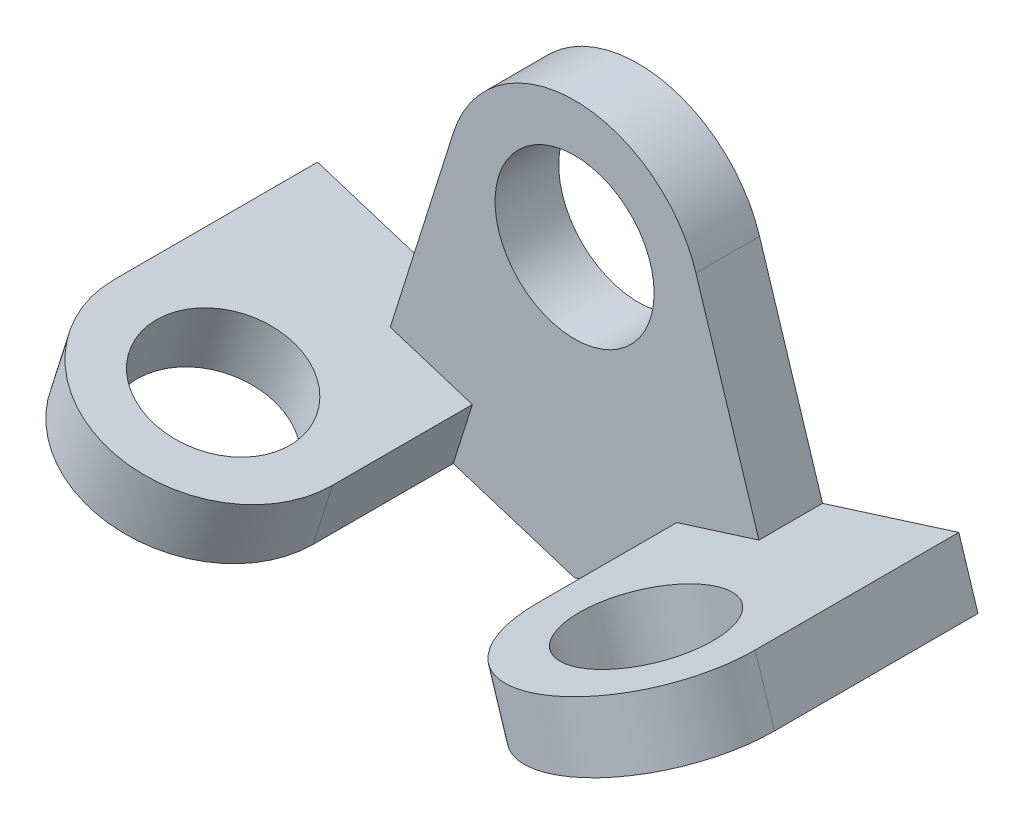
ISO-10303-21;
HEADER;
FILE_DESCRIPTION(('STEP AP214'),'2;1');
FILE_NAME('part.step','',(''),(''),'','','');
FILE_SCHEMA(('AUTOMOTIVE_DESIGN { 1 0 10303 214 1 1 1 1 }'));
ENDSEC;
DATA;
#1=APPLICATION_CONTEXT('core data for automotive mechanical design processes');
#2=APPLICATION_PROTOCOL_DEFINITION('international standard','automotive_design',2000,#1);
#3=PRODUCT_CONTEXT('',#1,'mechanical');
#4=PRODUCT('Part','Part','',(#3));
#5=PRODUCT_RELATED_PRODUCT_CATEGORY('part','',(#4));
#6=PRODUCT_DEFINITION_FORMATION('','',#4);
#7=PRODUCT_DEFINITION_CONTEXT('part definition',#1,'design');
#8=PRODUCT_DEFINITION('design','',#6,#7);
#9=PRODUCT_DEFINITION_SHAPE('','',#8);
#10=(LENGTH_UNIT() NAMED_UNIT(*) SI_UNIT(.MILLI.,.METRE.));
#11=(NAMED_UNIT(*) PLANE_ANGLE_UNIT() SI_UNIT($,.RADIAN.));
#12=(NAMED_UNIT(*) SI_UNIT($,.STERADIAN.) SOLID_ANGLE_UNIT());
#13=UNCERTAINTY_MEASURE_WITH_UNIT(LENGTH_MEASURE(1.E-05),#10,'distance_accuracy_value','');
#14=(GEOMETRIC_REPRESENTATION_CONTEXT(3) GLOBAL_UNCERTAINTY_ASSIGNED_CONTEXT((#13)) GLOBAL_UNIT_ASSIGNED_CONTEXT((#10,
#11,#12)) REPRESENTATION_CONTEXT('',''));
#15=CARTESIAN_POINT('',(0.,0.,0.));
#16=DIRECTION('',(0.,0.,1.));
#17=DIRECTION('',(1.,0.,0.));
#18=AXIS2_PLACEMENT_3D('',#15,#16,#17);
#19=CARTESIAN_POINT('',(0.,45.,10.));
#20=DIRECTION('',(0.,0.,-1.));
#21=DIRECTION('',(-1.,0.,0.));
#22=AXIS2_PLACEMENT_3D('',#19,#20,#21);
#23=PLANE('',#22);
#24=DIRECTION('',(0.953716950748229,-0.300705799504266,0.));
#25=VECTOR('',#24,1.);
#26=CARTESIAN_POINT('',(-9.8984118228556,13.6062485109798,10.));
#27=LINE('',#26,#25);
#28=CARTESIAN_POINT('',(-28.9727508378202,19.6203645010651,10.));
#29=VERTEX_POINT('',#28);
#30=CARTESIAN_POINT('',(-16.0672810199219,15.5512854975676,10.));
#31=VERTEX_POINT('',#30);
#32=EDGE_CURVE('E61',#29,#31,#27,.T.);
#33=ORIENTED_EDGE('',*,*,#32,.T.);
#34=DIRECTION('',(-0.300705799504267,-0.953716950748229,0.));
#35=VECTOR('',#34,1.);
#36=CARTESIAN_POINT('',(-6.1688691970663,46.9450369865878,10.));
#37=LINE('',#36,#35);
#38=CARTESIAN_POINT('',(-19.0743390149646,6.01411599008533,10.));
#39=VERTEX_POINT('',#38);
#40=EDGE_CURVE('E226',#31,#39,#37,.T.);
#41=ORIENTED_EDGE('',*,*,#40,.T.);
#42=DIRECTION('',(0.953716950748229,-0.300705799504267,0.));
#43=VECTOR('',#42,1.);
#44=CARTESIAN_POINT('',(0.,0.,10.));
#45=LINE('',#44,#43);
#46=CARTESIAN_POINT('',(0.,0.,10.));
#47=VERTEX_POINT('',#46);
#48=EDGE_CURVE('E160',#39,#47,#45,.T.);
#49=ORIENTED_EDGE('',*,*,#48,.T.);
#50=DIRECTION('',(0.953716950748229,0.300705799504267,0.));
#51=VECTOR('',#50,1.);
#52=CARTESIAN_POINT('',(0.,0.,10.));
#53=LINE('',#52,#51);
#54=CARTESIAN_POINT('',(19.0743390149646,6.01411599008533,10.));
#55=VERTEX_POINT('',#54);
#56=EDGE_CURVE('E250',#47,#55,#53,.T.);
#57=ORIENTED_EDGE('',*,*,#56,.T.);
#58=DIRECTION('',(-0.300705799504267,0.953716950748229,0.));
#59=VECTOR('',#58,1.);
#60=CARTESIAN_POINT('',(6.16886919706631,46.9450369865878,10.));
#61=LINE('',#60,#59);
#62=CARTESIAN_POINT('',(16.0672810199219,15.5512854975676,10.));
#63=VERTEX_POINT('',#62);
#64=EDGE_CURVE('E68',#55,#63,#61,.T.);
#65=ORIENTED_EDGE('',*,*,#64,.T.);
#66=DIRECTION('',(0.953716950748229,0.300705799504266,0.));
#67=VECTOR('',#66,1.);
#68=CARTESIAN_POINT('',(9.8984118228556,13.6062485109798,10.));
#69=LINE('',#68,#67);
#70=CARTESIAN_POINT('',(28.9727508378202,19.6203645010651,10.));
#71=VERTEX_POINT('',#70);
#72=EDGE_CURVE('E163',#63,#71,#69,.T.);
#73=ORIENTED_EDGE('',*,*,#72,.T.);
#74=DIRECTION('',(-0.300705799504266,0.953716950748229,0.));
#75=VECTOR('',#74,1.);
#76=CARTESIAN_POINT('',(31.9798088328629,10.0831949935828,10.));
#77=LINE('',#76,#75);
#78=CARTESIAN_POINT('',(19.0743390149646,51.0141159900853,10.));
#79=VERTEX_POINT('',#78);
#80=EDGE_CURVE('E253',#71,#79,#77,.T.);
#81=ORIENTED_EDGE('',*,*,#80,.T.);
#82=CARTESIAN_POINT('',(0.,45.,10.));
#83=DIRECTION('',(0.,0.,1.));
#84=DIRECTION('',(-1.,0.,0.));
#85=AXIS2_PLACEMENT_3D('',#82,#83,#84);
#86=CIRCLE('',#85,20.);
#87=CARTESIAN_POINT('',(-19.0743390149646,51.0141159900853,10.));
#88=VERTEX_POINT('',#87);
#89=EDGE_CURVE('E240',#79,#88,#86,.T.);
#90=ORIENTED_EDGE('',*,*,#89,.T.);
#91=DIRECTION('',(-0.300705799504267,-0.953716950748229,0.));
#92=VECTOR('',#91,1.);
#93=CARTESIAN_POINT('',(-31.9798088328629,10.0831949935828,10.));
#94=LINE('',#93,#92);
#95=EDGE_CURVE('E244',#88,#29,#94,.T.);
#96=ORIENTED_EDGE('',*,*,#95,.T.);
#97=EDGE_LOOP('',(#33,#41,#49,#57,#65,#73,#81,#90,#96));
#98=FACE_BOUND('',#97,.T.);
#99=CARTESIAN_POINT('',(0.,45.,10.));
#100=DIRECTION('',(0.,0.,1.));
#101=DIRECTION('',(1.,0.,0.));
#102=AXIS2_PLACEMENT_3D('',#99,#100,#101);
#103=CIRCLE('',#102,12.5);
#104=CARTESIAN_POINT('',(12.5,45.,10.));
#105=VERTEX_POINT('',#104);
#106=EDGE_CURVE('E232',#105,#105,#103,.T.);
#107=ORIENTED_EDGE('',*,*,#106,.F.);
#108=EDGE_LOOP('',(#107));
#109=FACE_BOUND('',#108,.T.);
#110=ADVANCED_FACE('F45',(#98,#109),#23,.F.);
#111=CARTESIAN_POINT('',(0.,45.,0.));
#112=DIRECTION('',(0.,0.,-1.));
#113=DIRECTION('',(-1.,0.,0.));
#114=AXIS2_PLACEMENT_3D('',#111,#112,#113);
#115=PLANE('',#114);
#116=DIRECTION('',(0.953716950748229,0.300705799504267,0.));
#117=VECTOR('',#116,1.);
#118=CARTESIAN_POINT('',(0.,0.,0.));
#119=LINE('',#118,#117);
#120=CARTESIAN_POINT('',(0.,0.,0.));
#121=VERTEX_POINT('',#120);
#122=CARTESIAN_POINT('',(53.4081492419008,16.8395247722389,0.));
#123=VERTEX_POINT('',#122);
#124=EDGE_CURVE('E266',#121,#123,#119,.T.);
#125=ORIENTED_EDGE('',*,*,#124,.F.);
#126=DIRECTION('',(0.953716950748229,-0.300705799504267,0.));
#127=VECTOR('',#126,1.);
#128=CARTESIAN_POINT('',(0.,0.,0.));
#129=LINE('',#128,#127);
#130=CARTESIAN_POINT('',(-53.4081492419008,16.8395247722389,0.));
#131=VERTEX_POINT('',#130);
#132=EDGE_CURVE('E263',#131,#121,#129,.T.);
#133=ORIENTED_EDGE('',*,*,#132,.F.);
#134=DIRECTION('',(0.300705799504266,0.953716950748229,0.));
#135=VECTOR('',#134,1.);
#136=CARTESIAN_POINT('',(-50.4010912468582,26.3766942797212,0.));
#137=LINE('',#136,#135);
#138=CARTESIAN_POINT('',(-50.4010912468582,26.3766942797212,0.));
#139=VERTEX_POINT('',#138);
#140=EDGE_CURVE('E179',#131,#139,#137,.T.);
#141=ORIENTED_EDGE('',*,*,#140,.T.);
#142=DIRECTION('',(0.953716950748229,-0.300705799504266,0.));
#143=VECTOR('',#142,1.);
#144=CARTESIAN_POINT('',(-16.0672810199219,15.5512854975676,0.));
#145=LINE('',#144,#143);
#146=CARTESIAN_POINT('',(-28.9727508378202,19.6203645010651,0.));
#147=VERTEX_POINT('',#146);
#148=EDGE_CURVE('E175',#139,#147,#145,.T.);
#149=ORIENTED_EDGE('',*,*,#148,.T.);
#150=DIRECTION('',(-0.300705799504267,-0.953716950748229,0.));
#151=VECTOR('',#150,1.);
#152=CARTESIAN_POINT('',(-31.9798088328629,10.0831949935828,0.));
#153=LINE('',#152,#151);
#154=CARTESIAN_POINT('',(-19.0743390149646,51.0141159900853,0.));
#155=VERTEX_POINT('',#154);
#156=EDGE_CURVE('E260',#155,#147,#153,.T.);
#157=ORIENTED_EDGE('',*,*,#156,.F.);
#158=CARTESIAN_POINT('',(0.,45.,0.));
#159=DIRECTION('',(0.,0.,1.));
#160=DIRECTION('',(-1.,0.,0.));
#161=AXIS2_PLACEMENT_3D('',#158,#159,#160);
#162=CIRCLE('',#161,20.);
#163=CARTESIAN_POINT('',(19.0743390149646,51.0141159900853,0.));
#164=VERTEX_POINT('',#163);
#165=EDGE_CURVE('E236',#164,#155,#162,.T.);
#166=ORIENTED_EDGE('',*,*,#165,.F.);
#167=DIRECTION('',(-0.300705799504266,0.953716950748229,0.));
#168=VECTOR('',#167,1.);
#169=CARTESIAN_POINT('',(31.9798088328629,10.0831949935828,0.));
#170=LINE('',#169,#168);
#171=CARTESIAN_POINT('',(28.9727508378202,19.6203645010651,0.));
#172=VERTEX_POINT('',#171);
#173=EDGE_CURVE('E245',#172,#164,#170,.T.);
#174=ORIENTED_EDGE('',*,*,#173,.F.);
#175=DIRECTION('',(0.953716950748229,0.300705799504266,0.));
#176=VECTOR('',#175,1.);
#177=CARTESIAN_POINT('',(16.0672810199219,15.5512854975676,0.));
#178=LINE('',#177,#176);
#179=CARTESIAN_POINT('',(50.4010912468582,26.3766942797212,0.));
#180=VERTEX_POINT('',#179);
#181=EDGE_CURVE('E183',#172,#180,#178,.T.);
#182=ORIENTED_EDGE('',*,*,#181,.T.);
#183=DIRECTION('',(0.300705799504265,-0.953716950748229,0.));
#184=VECTOR('',#183,1.);
#185=CARTESIAN_POINT('',(50.4010912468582,26.3766942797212,0.));
#186=LINE('',#185,#184);
#187=EDGE_CURVE('E209',#180,#123,#186,.T.);
#188=ORIENTED_EDGE('',*,*,#187,.T.);
#189=EDGE_LOOP('',(#125,#133,#141,#149,#157,#166,#174,#182,#188));
#190=FACE_BOUND('',#189,.T.);
#191=CARTESIAN_POINT('',(0.,45.,0.));
#192=DIRECTION('',(0.,0.,1.));
#193=DIRECTION('',(1.,0.,0.));
#194=AXIS2_PLACEMENT_3D('',#191,#192,#193);
#195=CIRCLE('',#194,12.5);
#196=CARTESIAN_POINT('',(12.5,45.,0.));
#197=VERTEX_POINT('',#196);
#198=EDGE_CURVE('E231',#197,#197,#195,.T.);
#199=ORIENTED_EDGE('',*,*,#198,.T.);
#200=EDGE_LOOP('',(#199));
#201=FACE_BOUND('',#200,.T.);
#202=ADVANCED_FACE('F295',(#190,#201),#115,.T.);
#203=CARTESIAN_POINT('',(0.,45.,10.));
#204=DIRECTION('',(0.,0.,-1.));
#205=DIRECTION('',(-1.,0.,0.));
#206=AXIS2_PLACEMENT_3D('',#203,#204,#205);
#207=CYLINDRICAL_SURFACE('',#206,20.);
#208=ORIENTED_EDGE('',*,*,#165,.T.);
#209=DIRECTION('',(0.,0.,-1.));
#210=VECTOR('',#209,1.);
#211=CARTESIAN_POINT('',(-19.0743390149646,51.0141159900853,10.));
#212=LINE('',#211,#210);
#213=EDGE_CURVE('E278',#88,#155,#212,.T.);
#214=ORIENTED_EDGE('',*,*,#213,.F.);
#215=ORIENTED_EDGE('',*,*,#89,.F.);
#216=DIRECTION('',(0.,0.,-1.));
#217=VECTOR('',#216,1.);
#218=CARTESIAN_POINT('',(19.0743390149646,51.0141159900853,10.));
#219=LINE('',#218,#217);
#220=EDGE_CURVE('E256',#79,#164,#219,.T.);
#221=ORIENTED_EDGE('',*,*,#220,.T.);
#222=EDGE_LOOP('',(#208,#214,#215,#221));
#223=FACE_BOUND('',#222,.T.);
#224=ADVANCED_FACE('F47',(#223),#207,.T.);
#225=CARTESIAN_POINT('',(-31.9798088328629,10.0831949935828,10.));
#226=DIRECTION('',(0.953716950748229,-0.300705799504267,0.));
#227=DIRECTION('',(0.300705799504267,0.953716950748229,0.));
#228=AXIS2_PLACEMENT_3D('',#225,#226,#227);
#229=PLANE('',#228);
#230=ORIENTED_EDGE('',*,*,#156,.T.);
#231=DIRECTION('',(0.,0.,1.));
#232=VECTOR('',#231,1.);
#233=CARTESIAN_POINT('',(-28.9727508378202,19.6203645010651,10.));
#234=LINE('',#233,#232);
#235=EDGE_CURVE('E11',#147,#29,#234,.T.);
#236=ORIENTED_EDGE('',*,*,#235,.T.);
#237=ORIENTED_EDGE('',*,*,#95,.F.);
#238=ORIENTED_EDGE('',*,*,#213,.T.);
#239=EDGE_LOOP('',(#230,#236,#237,#238));
#240=FACE_BOUND('',#239,.T.);
#241=ADVANCED_FACE('F377',(#240),#229,.F.);
#242=CARTESIAN_POINT('',(0.,0.,10.));
#243=DIRECTION('',(0.300705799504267,0.953716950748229,0.));
#244=DIRECTION('',(-0.953716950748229,0.300705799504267,0.));
#245=AXIS2_PLACEMENT_3D('',#242,#243,#244);
#246=PLANE('',#245);
#247=CARTESIAN_POINT('',(-36.2412441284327,11.4268203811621,32.));
#248=DIRECTION('',(0.300705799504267,0.953716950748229,0.));
#249=DIRECTION('',(-0.953716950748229,0.300705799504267,0.));
#250=AXIS2_PLACEMENT_3D('',#247,#248,#249);
#251=CIRCLE('',#250,11.);
#252=CARTESIAN_POINT('',(-46.7321305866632,14.7345841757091,32.));
#253=VERTEX_POINT('',#252);
#254=EDGE_CURVE('E327',#253,#253,#251,.T.);
#255=ORIENTED_EDGE('',*,*,#254,.T.);
#256=EDGE_LOOP('',(#255));
#257=FACE_BOUND('',#256,.T.);
#258=ORIENTED_EDGE('',*,*,#48,.F.);
#259=DIRECTION('',(0.,0.,-1.));
#260=VECTOR('',#259,1.);
#261=CARTESIAN_POINT('',(-19.0743390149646,6.01411599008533,32.));
#262=LINE('',#261,#260);
#263=CARTESIAN_POINT('',(-19.0743390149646,6.01411599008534,32.));
#264=VERTEX_POINT('',#263);
#265=EDGE_CURVE('E157',#264,#39,#262,.T.);
#266=ORIENTED_EDGE('',*,*,#265,.F.);
#267=CARTESIAN_POINT('',(-36.2412441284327,11.4268203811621,32.));
#268=DIRECTION('',(0.300705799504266,0.953716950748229,0.));
#269=DIRECTION('',(0.953716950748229,-0.300705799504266,0.));
#270=AXIS2_PLACEMENT_3D('',#267,#268,#269);
#271=CIRCLE('',#270,18.);
#272=CARTESIAN_POINT('',(-53.4081492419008,16.8395247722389,32.));
#273=VERTEX_POINT('',#272);
#274=EDGE_CURVE('E140',#273,#264,#271,.T.);
#275=ORIENTED_EDGE('',*,*,#274,.F.);
#276=DIRECTION('',(0.,0.,-1.));
#277=VECTOR('',#276,1.);
#278=CARTESIAN_POINT('',(-53.4081492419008,16.8395247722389,32.));
#279=LINE('',#278,#277);
#280=EDGE_CURVE('E169',#273,#131,#279,.T.);
#281=ORIENTED_EDGE('',*,*,#280,.T.);
#282=ORIENTED_EDGE('',*,*,#132,.T.);
#283=DIRECTION('',(0.,0.,-1.));
#284=VECTOR('',#283,1.);
#285=CARTESIAN_POINT('',(0.,0.,10.));
#286=LINE('',#285,#284);
#287=EDGE_CURVE('E274',#47,#121,#286,.T.);
#288=ORIENTED_EDGE('',*,*,#287,.F.);
#289=EDGE_LOOP('',(#258,#266,#275,#281,#282,#288));
#290=FACE_BOUND('',#289,.T.);
#291=ADVANCED_FACE('F158',(#257,#290),#246,.F.);
#292=CARTESIAN_POINT('',(0.,0.,10.));
#293=DIRECTION('',(-0.300705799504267,0.953716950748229,0.));
#294=DIRECTION('',(-0.953716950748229,-0.300705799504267,0.));
#295=AXIS2_PLACEMENT_3D('',#292,#293,#294);
#296=PLANE('',#295);
#297=CARTESIAN_POINT('',(36.2412441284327,11.4268203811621,32.));
#298=DIRECTION('',(-0.300705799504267,0.953716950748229,0.));
#299=DIRECTION('',(-0.953716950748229,-0.300705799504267,0.));
#300=AXIS2_PLACEMENT_3D('',#297,#298,#299);
#301=CIRCLE('',#300,11.);
#302=CARTESIAN_POINT('',(25.7503576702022,8.1190565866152,32.));
#303=VERTEX_POINT('',#302);
#304=EDGE_CURVE('E318',#303,#303,#301,.T.);
#305=ORIENTED_EDGE('',*,*,#304,.T.);
#306=EDGE_LOOP('',(#305));
#307=FACE_BOUND('',#306,.T.);
#308=DIRECTION('',(0.,0.,-1.));
#309=VECTOR('',#308,1.);
#310=CARTESIAN_POINT('',(19.0743390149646,6.01411599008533,32.));
#311=LINE('',#310,#309);
#312=CARTESIAN_POINT('',(19.0743390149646,6.01411599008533,32.));
#313=VERTEX_POINT('',#312);
#314=EDGE_CURVE('E191',#313,#55,#311,.T.);
#315=ORIENTED_EDGE('',*,*,#314,.T.);
#316=ORIENTED_EDGE('',*,*,#56,.F.);
#317=ORIENTED_EDGE('',*,*,#287,.T.);
#318=ORIENTED_EDGE('',*,*,#124,.T.);
#319=DIRECTION('',(0.,0.,-1.));
#320=VECTOR('',#319,1.);
#321=CARTESIAN_POINT('',(53.4081492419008,16.8395247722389,32.));
#322=LINE('',#321,#320);
#323=CARTESIAN_POINT('',(53.4081492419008,16.8395247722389,32.));
#324=VERTEX_POINT('',#323);
#325=EDGE_CURVE('E204',#324,#123,#322,.T.);
#326=ORIENTED_EDGE('',*,*,#325,.F.);
#327=CARTESIAN_POINT('',(36.2412441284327,11.4268203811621,32.));
#328=DIRECTION('',(-0.300705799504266,0.953716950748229,0.));
#329=DIRECTION('',(-0.953716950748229,-0.300705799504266,0.));
#330=AXIS2_PLACEMENT_3D('',#327,#328,#329);
#331=CIRCLE('',#330,18.);
#332=EDGE_CURVE('E208',#313,#324,#331,.T.);
#333=ORIENTED_EDGE('',*,*,#332,.F.);
#334=EDGE_LOOP('',(#315,#316,#317,#318,#326,#333));
#335=FACE_BOUND('',#334,.T.);
#336=ADVANCED_FACE('F313',(#307,#335),#296,.F.);
#337=CARTESIAN_POINT('',(31.9798088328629,10.0831949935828,10.));
#338=DIRECTION('',(-0.953716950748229,-0.300705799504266,0.));
#339=DIRECTION('',(0.300705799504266,-0.953716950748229,0.));
#340=AXIS2_PLACEMENT_3D('',#337,#338,#339);
#341=PLANE('',#340);
#342=ORIENTED_EDGE('',*,*,#80,.F.);
#343=DIRECTION('',(0.,0.,-1.));
#344=VECTOR('',#343,1.);
#345=CARTESIAN_POINT('',(28.9727508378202,19.6203645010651,10.));
#346=LINE('',#345,#344);
#347=EDGE_CURVE('E54',#71,#172,#346,.T.);
#348=ORIENTED_EDGE('',*,*,#347,.T.);
#349=ORIENTED_EDGE('',*,*,#173,.T.);
#350=ORIENTED_EDGE('',*,*,#220,.F.);
#351=EDGE_LOOP('',(#342,#348,#349,#350));
#352=FACE_BOUND('',#351,.T.);
#353=ADVANCED_FACE('F287',(#352),#341,.F.);
#354=CARTESIAN_POINT('',(0.,45.,10.));
#355=DIRECTION('',(0.,0.,-1.));
#356=DIRECTION('',(-1.,0.,0.));
#357=AXIS2_PLACEMENT_3D('',#354,#355,#356);
#358=CYLINDRICAL_SURFACE('',#357,12.5);
#359=ORIENTED_EDGE('',*,*,#106,.T.);
#360=EDGE_LOOP('',(#359));
#361=FACE_BOUND('',#360,.T.);
#362=ORIENTED_EDGE('',*,*,#198,.F.);
#363=EDGE_LOOP('',(#362));
#364=FACE_BOUND('',#363,.T.);
#365=ADVANCED_FACE('F369',(#361,#364),#358,.F.);
#366=CARTESIAN_POINT('',(19.0743390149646,6.01411599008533,32.));
#367=DIRECTION('',(-0.953716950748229,-0.300705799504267,0.));
#368=DIRECTION('',(0.300705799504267,-0.953716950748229,0.));
#369=AXIS2_PLACEMENT_3D('',#366,#367,#368);
#370=PLANE('',#369);
#371=ORIENTED_EDGE('',*,*,#64,.F.);
#372=ORIENTED_EDGE('',*,*,#314,.F.);
#373=DIRECTION('',(-0.300705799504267,0.953716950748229,0.));
#374=VECTOR('',#373,1.);
#375=CARTESIAN_POINT('',(19.0743390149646,6.01411599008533,32.));
#376=LINE('',#375,#374);
#377=CARTESIAN_POINT('',(16.0672810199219,15.5512854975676,32.));
#378=VERTEX_POINT('',#377);
#379=EDGE_CURVE('E213',#313,#378,#376,.T.);
#380=ORIENTED_EDGE('',*,*,#379,.T.);
#381=DIRECTION('',(0.,0.,-1.));
#382=VECTOR('',#381,1.);
#383=CARTESIAN_POINT('',(16.0672810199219,15.5512854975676,32.));
#384=LINE('',#383,#382);
#385=EDGE_CURVE('E196',#378,#63,#384,.T.);
#386=ORIENTED_EDGE('',*,*,#385,.T.);
#387=EDGE_LOOP('',(#371,#372,#380,#386));
#388=FACE_BOUND('',#387,.T.);
#389=ADVANCED_FACE('F304',(#388),#370,.T.);
#390=CARTESIAN_POINT('',(16.0672810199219,15.5512854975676,32.));
#391=DIRECTION('',(-0.300705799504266,0.953716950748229,0.));
#392=DIRECTION('',(-0.953716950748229,-0.300705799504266,0.));
#393=AXIS2_PLACEMENT_3D('',#390,#391,#392);
#394=PLANE('',#393);
#395=CARTESIAN_POINT('',(33.23418613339,20.9639898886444,32.));
#396=DIRECTION('',(-0.300705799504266,0.953716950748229,0.));
#397=DIRECTION('',(-0.953716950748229,-0.300705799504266,0.));
#398=AXIS2_PLACEMENT_3D('',#395,#396,#397);
#399=CIRCLE('',#398,11.);
#400=CARTESIAN_POINT('',(22.7432996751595,17.6562260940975,32.));
#401=VERTEX_POINT('',#400);
#402=EDGE_CURVE('E152',#401,#401,#399,.T.);
#403=ORIENTED_EDGE('',*,*,#402,.F.);
#404=EDGE_LOOP('',(#403));
#405=FACE_BOUND('',#404,.T.);
#406=ORIENTED_EDGE('',*,*,#72,.F.);
#407=ORIENTED_EDGE('',*,*,#385,.F.);
#408=CARTESIAN_POINT('',(33.23418613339,20.9639898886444,32.));
#409=DIRECTION('',(-0.300705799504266,0.953716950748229,0.));
#410=DIRECTION('',(-0.953716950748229,-0.300705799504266,0.));
#411=AXIS2_PLACEMENT_3D('',#408,#409,#410);
#412=CIRCLE('',#411,18.);
#413=CARTESIAN_POINT('',(50.4010912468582,26.3766942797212,32.));
#414=VERTEX_POINT('',#413);
#415=EDGE_CURVE('E311',#378,#414,#412,.T.);
#416=ORIENTED_EDGE('',*,*,#415,.T.);
#417=DIRECTION('',(0.,0.,-1.));
#418=VECTOR('',#417,1.);
#419=CARTESIAN_POINT('',(50.4010912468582,26.3766942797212,32.));
#420=LINE('',#419,#418);
#421=EDGE_CURVE('E200',#414,#180,#420,.T.);
#422=ORIENTED_EDGE('',*,*,#421,.T.);
#423=ORIENTED_EDGE('',*,*,#181,.F.);
#424=ORIENTED_EDGE('',*,*,#347,.F.);
#425=EDGE_LOOP('',(#406,#407,#416,#422,#423,#424));
#426=FACE_BOUND('',#425,.T.);
#427=ADVANCED_FACE('F290',(#405,#426),#394,.T.);
#428=CARTESIAN_POINT('',(50.4010912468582,26.3766942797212,32.));
#429=DIRECTION('',(0.95371695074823,0.300705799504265,0.));
#430=DIRECTION('',(-0.300705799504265,0.95371695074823,0.));
#431=AXIS2_PLACEMENT_3D('',#428,#429,#430);
#432=PLANE('',#431);
#433=ORIENTED_EDGE('',*,*,#187,.F.);
#434=ORIENTED_EDGE('',*,*,#421,.F.);
#435=DIRECTION('',(0.300705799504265,-0.953716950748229,0.));
#436=VECTOR('',#435,1.);
#437=CARTESIAN_POINT('',(50.4010912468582,26.3766942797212,32.));
#438=LINE('',#437,#436);
#439=EDGE_CURVE('E195',#414,#324,#438,.T.);
#440=ORIENTED_EDGE('',*,*,#439,.T.);
#441=ORIENTED_EDGE('',*,*,#325,.T.);
#442=EDGE_LOOP('',(#433,#434,#440,#441));
#443=FACE_BOUND('',#442,.T.);
#444=ADVANCED_FACE('F343',(#443),#432,.T.);
#445=CARTESIAN_POINT('',(-16.0672810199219,15.5512854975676,32.));
#446=DIRECTION('',(0.300705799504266,0.953716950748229,0.));
#447=DIRECTION('',(-0.953716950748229,0.300705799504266,0.));
#448=AXIS2_PLACEMENT_3D('',#445,#446,#447);
#449=PLANE('',#448);
#450=CARTESIAN_POINT('',(-33.2341861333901,20.9639898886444,32.));
#451=DIRECTION('',(0.300705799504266,0.953716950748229,0.));
#452=DIRECTION('',(-0.953716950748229,0.300705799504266,0.));
#453=AXIS2_PLACEMENT_3D('',#450,#451,#452);
#454=CIRCLE('',#453,11.);
#455=CARTESIAN_POINT('',(-43.7250725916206,24.2717536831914,32.));
#456=VERTEX_POINT('',#455);
#457=EDGE_CURVE('E332',#456,#456,#454,.T.);
#458=ORIENTED_EDGE('',*,*,#457,.F.);
#459=EDGE_LOOP('',(#458));
#460=FACE_BOUND('',#459,.T.);
#461=ORIENTED_EDGE('',*,*,#32,.F.);
#462=ORIENTED_EDGE('',*,*,#235,.F.);
#463=ORIENTED_EDGE('',*,*,#148,.F.);
#464=DIRECTION('',(0.,0.,-1.));
#465=VECTOR('',#464,1.);
#466=CARTESIAN_POINT('',(-50.4010912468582,26.3766942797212,32.));
#467=LINE('',#466,#465);
#468=CARTESIAN_POINT('',(-50.4010912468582,26.3766942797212,32.));
#469=VERTEX_POINT('',#468);
#470=EDGE_CURVE('E173',#469,#139,#467,.T.);
#471=ORIENTED_EDGE('',*,*,#470,.F.);
#472=CARTESIAN_POINT('',(-33.23418613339,20.9639898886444,32.));
#473=DIRECTION('',(0.300705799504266,0.953716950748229,0.));
#474=DIRECTION('',(0.953716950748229,-0.300705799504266,0.));
#475=AXIS2_PLACEMENT_3D('',#472,#473,#474);
#476=CIRCLE('',#475,18.);
#477=CARTESIAN_POINT('',(-16.0672810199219,15.5512854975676,32.));
#478=VERTEX_POINT('',#477);
#479=EDGE_CURVE('E153',#469,#478,#476,.T.);
#480=ORIENTED_EDGE('',*,*,#479,.T.);
#481=DIRECTION('',(0.,0.,-1.));
#482=VECTOR('',#481,1.);
#483=CARTESIAN_POINT('',(-16.0672810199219,15.5512854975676,32.));
#484=LINE('',#483,#482);
#485=EDGE_CURVE('E164',#478,#31,#484,.T.);
#486=ORIENTED_EDGE('',*,*,#485,.T.);
#487=EDGE_LOOP('',(#461,#462,#463,#471,#480,#486));
#488=FACE_BOUND('',#487,.T.);
#489=ADVANCED_FACE('F340',(#460,#488),#449,.T.);
#490=CARTESIAN_POINT('',(-19.0743390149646,6.01411599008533,32.));
#491=DIRECTION('',(0.953716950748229,-0.300705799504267,0.));
#492=DIRECTION('',(0.300705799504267,0.953716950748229,0.));
#493=AXIS2_PLACEMENT_3D('',#490,#491,#492);
#494=PLANE('',#493);
#495=ORIENTED_EDGE('',*,*,#40,.F.);
#496=ORIENTED_EDGE('',*,*,#485,.F.);
#497=DIRECTION('',(-0.300705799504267,-0.953716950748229,0.));
#498=VECTOR('',#497,1.);
#499=CARTESIAN_POINT('',(-19.0743390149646,6.01411599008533,32.));
#500=LINE('',#499,#498);
#501=EDGE_CURVE('E144',#478,#264,#500,.T.);
#502=ORIENTED_EDGE('',*,*,#501,.T.);
#503=ORIENTED_EDGE('',*,*,#265,.T.);
#504=EDGE_LOOP('',(#495,#496,#502,#503));
#505=FACE_BOUND('',#504,.T.);
#506=ADVANCED_FACE('F166',(#505),#494,.T.);
#507=CARTESIAN_POINT('',(-50.4010912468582,26.3766942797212,32.));
#508=DIRECTION('',(-0.953716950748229,0.300705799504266,0.));
#509=DIRECTION('',(-0.300705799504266,-0.953716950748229,0.));
#510=AXIS2_PLACEMENT_3D('',#507,#508,#509);
#511=PLANE('',#510);
#512=ORIENTED_EDGE('',*,*,#140,.F.);
#513=ORIENTED_EDGE('',*,*,#280,.F.);
#514=DIRECTION('',(0.300705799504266,0.953716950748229,0.));
#515=VECTOR('',#514,1.);
#516=CARTESIAN_POINT('',(-50.4010912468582,26.3766942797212,32.));
#517=LINE('',#516,#515);
#518=EDGE_CURVE('E147',#273,#469,#517,.T.);
#519=ORIENTED_EDGE('',*,*,#518,.T.);
#520=ORIENTED_EDGE('',*,*,#470,.T.);
#521=EDGE_LOOP('',(#512,#513,#519,#520));
#522=FACE_BOUND('',#521,.T.);
#523=ADVANCED_FACE('F350',(#522),#511,.T.);
#524=CARTESIAN_POINT('',(36.2412441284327,11.4268203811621,32.));
#525=DIRECTION('',(-0.300705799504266,0.953716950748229,0.));
#526=DIRECTION('',(-0.953716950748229,-0.300705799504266,0.));
#527=AXIS2_PLACEMENT_3D('',#524,#525,#526);
#528=CYLINDRICAL_SURFACE('',#527,18.);
#529=ORIENTED_EDGE('',*,*,#415,.F.);
#530=ORIENTED_EDGE('',*,*,#379,.F.);
#531=ORIENTED_EDGE('',*,*,#332,.T.);
#532=ORIENTED_EDGE('',*,*,#439,.F.);
#533=EDGE_LOOP('',(#529,#530,#531,#532));
#534=FACE_BOUND('',#533,.T.);
#535=ADVANCED_FACE('F308',(#534),#528,.T.);
#536=CARTESIAN_POINT('',(41.0706214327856,-3.89000757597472,32.));
#537=DIRECTION('',(-0.300705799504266,0.953716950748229,0.));
#538=DIRECTION('',(-0.953716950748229,-0.300705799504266,0.));
#539=AXIS2_PLACEMENT_3D('',#536,#537,#538);
#540=CYLINDRICAL_SURFACE('',#539,11.);
#541=ORIENTED_EDGE('',*,*,#402,.T.);
#542=EDGE_LOOP('',(#541));
#543=FACE_BOUND('',#542,.T.);
#544=ORIENTED_EDGE('',*,*,#304,.F.);
#545=EDGE_LOOP('',(#544));
#546=FACE_BOUND('',#545,.T.);
#547=ADVANCED_FACE('F481',(#543,#546),#540,.F.);
#548=CARTESIAN_POINT('',(-36.2412441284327,11.4268203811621,32.));
#549=DIRECTION('',(0.300705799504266,0.953716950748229,0.));
#550=DIRECTION('',(-0.953716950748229,0.300705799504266,0.));
#551=AXIS2_PLACEMENT_3D('',#548,#549,#550);
#552=CYLINDRICAL_SURFACE('',#551,18.);
#553=ORIENTED_EDGE('',*,*,#479,.F.);
#554=ORIENTED_EDGE('',*,*,#518,.F.);
#555=ORIENTED_EDGE('',*,*,#274,.T.);
#556=ORIENTED_EDGE('',*,*,#501,.F.);
#557=EDGE_LOOP('',(#553,#554,#555,#556));
#558=FACE_BOUND('',#557,.T.);
#559=ADVANCED_FACE('F142',(#558),#552,.T.);
#560=CARTESIAN_POINT('',(-41.0706214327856,-3.89000757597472,32.));
#561=DIRECTION('',(0.300705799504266,0.953716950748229,0.));
#562=DIRECTION('',(-0.953716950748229,0.300705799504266,0.));
#563=AXIS2_PLACEMENT_3D('',#560,#561,#562);
#564=CYLINDRICAL_SURFACE('',#563,11.);
#565=ORIENTED_EDGE('',*,*,#457,.T.);
#566=EDGE_LOOP('',(#565));
#567=FACE_BOUND('',#566,.T.);
#568=ORIENTED_EDGE('',*,*,#254,.F.);
#569=EDGE_LOOP('',(#568));
#570=FACE_BOUND('',#569,.T.);
#571=ADVANCED_FACE('F337',(#567,#570),#564,.F.);
#572=CLOSED_SHELL('',(#110,#202,#224,#241,#291,#336,#353,#365,#389,#427,#444,#489,#506,#523,
#535,#547,#559,#571));
#573=MANIFOLD_SOLID_BREP('B2',#572);
#574=ADVANCED_BREP_SHAPE_REPRESENTATION('',(#18,#573),#14);
#575=SHAPE_DEFINITION_REPRESENTATION(#9,#574);
ENDSEC;
END-ISO-10303-21;
